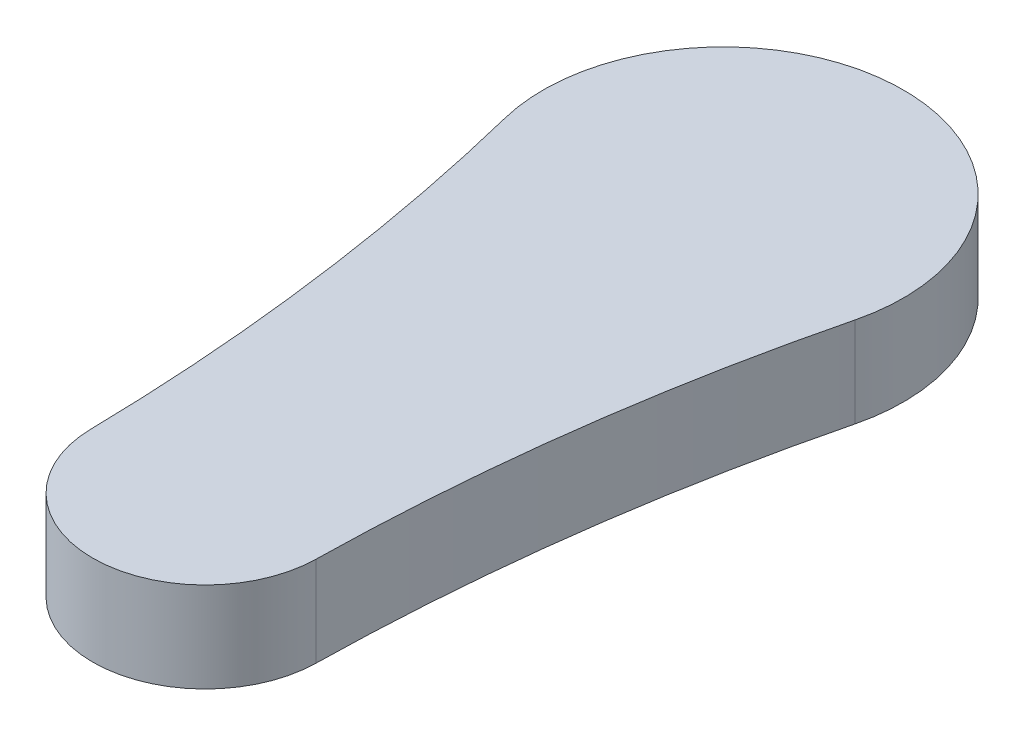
ISO-10303-21;
HEADER;
FILE_DESCRIPTION(('STEP AP214'),'2;1');
FILE_NAME('part.step','',(''),(''),'','','');
FILE_SCHEMA(('AUTOMOTIVE_DESIGN { 1 0 10303 214 1 1 1 1 }'));
ENDSEC;
DATA;
#1=APPLICATION_CONTEXT('core data for automotive mechanical design processes');
#2=APPLICATION_PROTOCOL_DEFINITION('international standard','automotive_design',2000,#1);
#3=PRODUCT_CONTEXT('',#1,'mechanical');
#4=PRODUCT('Part','Part','',(#3));
#5=PRODUCT_RELATED_PRODUCT_CATEGORY('part','',(#4));
#6=PRODUCT_DEFINITION_FORMATION('','',#4);
#7=PRODUCT_DEFINITION_CONTEXT('part definition',#1,'design');
#8=PRODUCT_DEFINITION('design','',#6,#7);
#9=PRODUCT_DEFINITION_SHAPE('','',#8);
#10=(LENGTH_UNIT() NAMED_UNIT(*) SI_UNIT(.MILLI.,.METRE.));
#11=(NAMED_UNIT(*) PLANE_ANGLE_UNIT() SI_UNIT($,.RADIAN.));
#12=(NAMED_UNIT(*) SI_UNIT($,.STERADIAN.) SOLID_ANGLE_UNIT());
#13=UNCERTAINTY_MEASURE_WITH_UNIT(LENGTH_MEASURE(1.E-05),#10,'distance_accuracy_value','');
#14=(GEOMETRIC_REPRESENTATION_CONTEXT(3) GLOBAL_UNCERTAINTY_ASSIGNED_CONTEXT((#13)) GLOBAL_UNIT_ASSIGNED_CONTEXT((#10,
#11,#12)) REPRESENTATION_CONTEXT('',''));
#15=CARTESIAN_POINT('',(0.,0.,0.));
#16=DIRECTION('',(0.,0.,1.));
#17=DIRECTION('',(1.,0.,0.));
#18=AXIS2_PLACEMENT_3D('',#15,#16,#17);
#19=CARTESIAN_POINT('',(0.,50.8,-292.1));
#20=DIRECTION('',(0.,-1.,0.));
#21=DIRECTION('',(0.,0.,-1.));
#22=AXIS2_PLACEMENT_3D('',#19,#20,#21);
#23=CYLINDRICAL_SURFACE('',#22,101.6);
#24=CARTESIAN_POINT('',(0.,0.,-292.1));
#25=DIRECTION('',(0.,1.,0.));
#26=DIRECTION('',(0.,0.,1.));
#27=AXIS2_PLACEMENT_3D('',#24,#25,#26);
#28=CIRCLE('',#27,101.6);
#29=CARTESIAN_POINT('',(98.6131103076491,0.,-267.645665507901));
#30=VERTEX_POINT('',#29);
#31=CARTESIAN_POINT('',(-98.6131103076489,0.,-267.645665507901));
#32=VERTEX_POINT('',#31);
#33=EDGE_CURVE('E97',#30,#32,#28,.T.);
#34=ORIENTED_EDGE('',*,*,#33,.T.);
#35=DIRECTION('',(0.,-1.,0.));
#36=VECTOR('',#35,1.);
#37=CARTESIAN_POINT('',(-98.6131103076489,50.8,-267.645665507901));
#38=LINE('',#37,#36);
#39=CARTESIAN_POINT('',(-98.6131103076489,50.8,-267.645665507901));
#40=VERTEX_POINT('',#39);
#41=EDGE_CURVE('E11',#40,#32,#38,.T.);
#42=ORIENTED_EDGE('',*,*,#41,.F.);
#43=CARTESIAN_POINT('',(0.,50.8,-292.1));
#44=DIRECTION('',(0.,1.,0.));
#45=DIRECTION('',(0.,0.,1.));
#46=AXIS2_PLACEMENT_3D('',#43,#44,#45);
#47=CIRCLE('',#46,101.6);
#48=CARTESIAN_POINT('',(98.6131103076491,50.8,-267.645665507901));
#49=VERTEX_POINT('',#48);
#50=EDGE_CURVE('E85',#49,#40,#47,.T.);
#51=ORIENTED_EDGE('',*,*,#50,.F.);
#52=DIRECTION('',(0.,-1.,0.));
#53=VECTOR('',#52,1.);
#54=CARTESIAN_POINT('',(98.6131103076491,50.8,-267.645665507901));
#55=LINE('',#54,#53);
#56=EDGE_CURVE('E93',#49,#30,#55,.T.);
#57=ORIENTED_EDGE('',*,*,#56,.T.);
#58=EDGE_LOOP('',(#34,#42,#51,#57));
#59=FACE_BOUND('',#58,.T.);
#60=ADVANCED_FACE('F34',(#59),#23,.T.);
#61=CARTESIAN_POINT('',(-1263.81089782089,50.8,21.3030995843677));
#62=DIRECTION('',(0.,-1.,0.));
#63=DIRECTION('',(0.,0.,-1.));
#64=AXIS2_PLACEMENT_3D('',#61,#62,#63);
#65=CYLINDRICAL_SURFACE('',#64,1200.49043014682);
#66=CARTESIAN_POINT('',(-1263.81089782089,0.,21.3030995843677));
#67=DIRECTION('',(0.,-1.,0.));
#68=DIRECTION('',(0.,0.,1.));
#69=AXIS2_PLACEMENT_3D('',#66,#67,#68);
#70=CIRCLE('',#69,1200.49043014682);
#71=CARTESIAN_POINT('',(-63.4909807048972,0.,1.07021919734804));
#72=VERTEX_POINT('',#71);
#73=EDGE_CURVE('E89',#32,#72,#70,.T.);
#74=ORIENTED_EDGE('',*,*,#73,.T.);
#75=DIRECTION('',(0.,-1.,0.));
#76=VECTOR('',#75,1.);
#77=CARTESIAN_POINT('',(-63.4909807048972,50.8,1.07021919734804));
#78=LINE('',#77,#76);
#79=CARTESIAN_POINT('',(-63.4909807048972,50.8,1.07021919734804));
#80=VERTEX_POINT('',#79);
#81=EDGE_CURVE('E42',#80,#72,#78,.T.);
#82=ORIENTED_EDGE('',*,*,#81,.F.);
#83=CARTESIAN_POINT('',(-1263.81089782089,50.8,21.3030995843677));
#84=DIRECTION('',(0.,-1.,0.));
#85=DIRECTION('',(0.,0.,1.));
#86=AXIS2_PLACEMENT_3D('',#83,#84,#85);
#87=CIRCLE('',#86,1200.49043014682);
#88=EDGE_CURVE('E80',#40,#80,#87,.T.);
#89=ORIENTED_EDGE('',*,*,#88,.F.);
#90=ORIENTED_EDGE('',*,*,#41,.T.);
#91=EDGE_LOOP('',(#74,#82,#89,#90));
#92=FACE_BOUND('',#91,.T.);
#93=ADVANCED_FACE('F88',(#92),#65,.F.);
#94=CARTESIAN_POINT('',(0.,50.8,0.));
#95=DIRECTION('',(0.,-1.,0.));
#96=DIRECTION('',(0.,0.,-1.));
#97=AXIS2_PLACEMENT_3D('',#94,#95,#96);
#98=CYLINDRICAL_SURFACE('',#97,63.5);
#99=CARTESIAN_POINT('',(0.,0.,0.));
#100=DIRECTION('',(0.,1.,0.));
#101=DIRECTION('',(0.,0.,1.));
#102=AXIS2_PLACEMENT_3D('',#99,#100,#101);
#103=CIRCLE('',#102,63.5);
#104=CARTESIAN_POINT('',(63.4909807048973,0.,1.07021919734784));
#105=VERTEX_POINT('',#104);
#106=EDGE_CURVE('E67',#72,#105,#103,.T.);
#107=ORIENTED_EDGE('',*,*,#106,.T.);
#108=DIRECTION('',(0.,-1.,0.));
#109=VECTOR('',#108,1.);
#110=CARTESIAN_POINT('',(63.4909807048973,50.8,1.07021919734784));
#111=LINE('',#110,#109);
#112=CARTESIAN_POINT('',(63.4909807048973,50.8,1.07021919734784));
#113=VERTEX_POINT('',#112);
#114=EDGE_CURVE('E90',#113,#105,#111,.T.);
#115=ORIENTED_EDGE('',*,*,#114,.F.);
#116=CARTESIAN_POINT('',(0.,50.8,0.));
#117=DIRECTION('',(0.,1.,0.));
#118=DIRECTION('',(0.,0.,1.));
#119=AXIS2_PLACEMENT_3D('',#116,#117,#118);
#120=CIRCLE('',#119,63.5);
#121=EDGE_CURVE('E83',#80,#113,#120,.T.);
#122=ORIENTED_EDGE('',*,*,#121,.F.);
#123=ORIENTED_EDGE('',*,*,#81,.T.);
#124=EDGE_LOOP('',(#107,#115,#122,#123));
#125=FACE_BOUND('',#124,.T.);
#126=ADVANCED_FACE('F91',(#125),#98,.T.);
#127=CARTESIAN_POINT('',(1263.81089782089,50.8,21.3030995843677));
#128=DIRECTION('',(0.,-1.,0.));
#129=DIRECTION('',(0.,0.,-1.));
#130=AXIS2_PLACEMENT_3D('',#127,#128,#129);
#131=CYLINDRICAL_SURFACE('',#130,1200.49043014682);
#132=CARTESIAN_POINT('',(1263.81089782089,0.,21.3030995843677));
#133=DIRECTION('',(0.,-1.,0.));
#134=DIRECTION('',(0.,0.,1.));
#135=AXIS2_PLACEMENT_3D('',#132,#133,#134);
#136=CIRCLE('',#135,1200.49043014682);
#137=EDGE_CURVE('E73',#105,#30,#136,.T.);
#138=ORIENTED_EDGE('',*,*,#137,.T.);
#139=ORIENTED_EDGE('',*,*,#56,.F.);
#140=CARTESIAN_POINT('',(1263.81089782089,50.8,21.3030995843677));
#141=DIRECTION('',(0.,-1.,0.));
#142=DIRECTION('',(0.,0.,1.));
#143=AXIS2_PLACEMENT_3D('',#140,#141,#142);
#144=CIRCLE('',#143,1200.49043014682);
#145=EDGE_CURVE('E50',#113,#49,#144,.T.);
#146=ORIENTED_EDGE('',*,*,#145,.F.);
#147=ORIENTED_EDGE('',*,*,#114,.T.);
#148=EDGE_LOOP('',(#138,#139,#146,#147));
#149=FACE_BOUND('',#148,.T.);
#150=ADVANCED_FACE('F104',(#149),#131,.F.);
#151=CARTESIAN_POINT('',(-631.905448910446,50.8,-135.398450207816));
#152=DIRECTION('',(0.,1.,0.));
#153=DIRECTION('',(0.,0.,1.));
#154=AXIS2_PLACEMENT_3D('',#151,#152,#153);
#155=PLANE('',#154);
#156=ORIENTED_EDGE('',*,*,#50,.T.);
#157=ORIENTED_EDGE('',*,*,#88,.T.);
#158=ORIENTED_EDGE('',*,*,#121,.T.);
#159=ORIENTED_EDGE('',*,*,#145,.T.);
#160=EDGE_LOOP('',(#156,#157,#158,#159));
#161=FACE_BOUND('',#160,.T.);
#162=ADVANCED_FACE('F81',(#161),#155,.T.);
#163=CARTESIAN_POINT('',(-631.905448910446,0.,-135.398450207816));
#164=DIRECTION('',(0.,1.,0.));
#165=DIRECTION('',(0.,0.,1.));
#166=AXIS2_PLACEMENT_3D('',#163,#164,#165);
#167=PLANE('',#166);
#168=ORIENTED_EDGE('',*,*,#33,.F.);
#169=ORIENTED_EDGE('',*,*,#137,.F.);
#170=ORIENTED_EDGE('',*,*,#106,.F.);
#171=ORIENTED_EDGE('',*,*,#73,.F.);
#172=EDGE_LOOP('',(#168,#169,#170,#171));
#173=FACE_BOUND('',#172,.T.);
#174=ADVANCED_FACE('F107',(#173),#167,.F.);
#175=CLOSED_SHELL('',(#60,#93,#126,#150,#162,#174));
#176=MANIFOLD_SOLID_BREP('B2',#175);
#177=ADVANCED_BREP_SHAPE_REPRESENTATION('',(#18,#176),#14);
#178=SHAPE_DEFINITION_REPRESENTATION(#9,#177);
ENDSEC;
END-ISO-10303-21;
